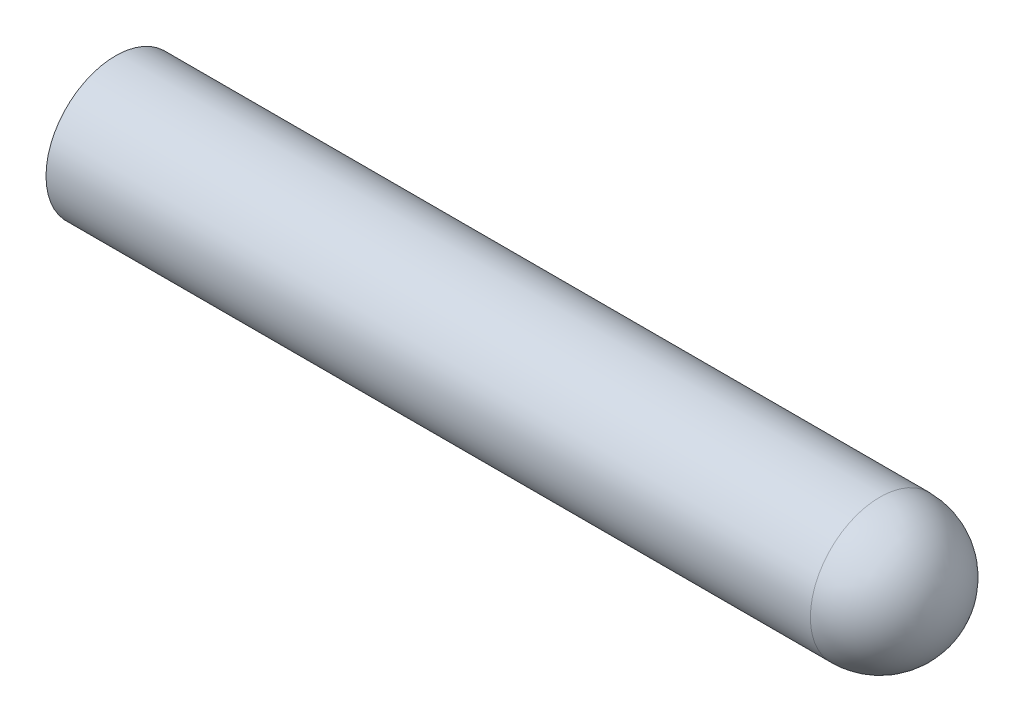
from build123d import *


with BuildPart() as part:
    # Esquisse1 → R_volution1 (revolve)
    with BuildSketch(Plane.XY, mode=Mode.PRIVATE) as r_volution1_sk:
        with BuildLine():
            Line((0, 0), (60, 0))
            ThreePointArc((60, 0), (58.535533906, 3.535533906), (55, 5))
            Line((55, 5), (0, 5))
            Line((0, 5), (0, 0))
        make_face()
    revolve(r_volution1_sk.sketch.rotate(Axis((0, 0, 0), (1, 0, 0)), 180), axis=Axis((0, 0, 0), (1, 0, 0)))


solid = part.part
